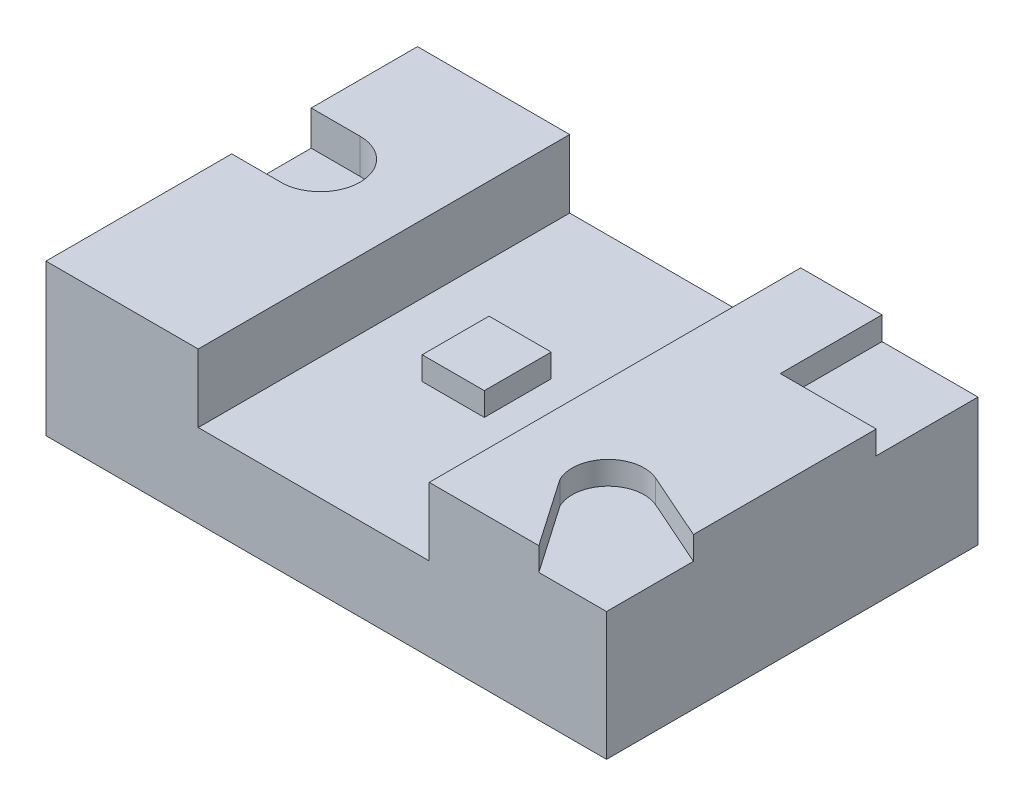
ISO-10303-21;
HEADER;
FILE_DESCRIPTION(('STEP AP214'),'2;1');
FILE_NAME('part.step','',(''),(''),'','','');
FILE_SCHEMA(('AUTOMOTIVE_DESIGN { 1 0 10303 214 1 1 1 1 }'));
ENDSEC;
DATA;
#1=APPLICATION_CONTEXT('core data for automotive mechanical design processes');
#2=APPLICATION_PROTOCOL_DEFINITION('international standard','automotive_design',2000,#1);
#3=PRODUCT_CONTEXT('',#1,'mechanical');
#4=PRODUCT('Part','Part','',(#3));
#5=PRODUCT_RELATED_PRODUCT_CATEGORY('part','',(#4));
#6=PRODUCT_DEFINITION_FORMATION('','',#4);
#7=PRODUCT_DEFINITION_CONTEXT('part definition',#1,'design');
#8=PRODUCT_DEFINITION('design','',#6,#7);
#9=PRODUCT_DEFINITION_SHAPE('','',#8);
#10=(LENGTH_UNIT() NAMED_UNIT(*) SI_UNIT(.MILLI.,.METRE.));
#11=(NAMED_UNIT(*) PLANE_ANGLE_UNIT() SI_UNIT($,.RADIAN.));
#12=(NAMED_UNIT(*) SI_UNIT($,.STERADIAN.) SOLID_ANGLE_UNIT());
#13=UNCERTAINTY_MEASURE_WITH_UNIT(LENGTH_MEASURE(1.E-05),#10,'distance_accuracy_value','');
#14=(GEOMETRIC_REPRESENTATION_CONTEXT(3) GLOBAL_UNCERTAINTY_ASSIGNED_CONTEXT((#13)) GLOBAL_UNIT_ASSIGNED_CONTEXT((#10,
#11,#12)) REPRESENTATION_CONTEXT('',''));
#15=CARTESIAN_POINT('',(0.,0.,0.));
#16=DIRECTION('',(0.,0.,1.));
#17=DIRECTION('',(1.,0.,0.));
#18=AXIS2_PLACEMENT_3D('',#15,#16,#17);
#19=CARTESIAN_POINT('',(26.4480769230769,28.4071937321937,101.6));
#20=DIRECTION('',(0.,-1.,0.));
#21=DIRECTION('',(0.,0.,-1.));
#22=AXIS2_PLACEMENT_3D('',#19,#20,#21);
#23=PLANE('',#22);
#24=DIRECTION('',(-1.,0.,0.));
#25=VECTOR('',#24,1.);
#26=CARTESIAN_POINT('',(26.4480769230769,28.4071937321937,0.));
#27=LINE('',#26,#25);
#28=CARTESIAN_POINT('',(26.4480769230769,28.4071937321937,0.));
#29=VERTEX_POINT('',#28);
#30=CARTESIAN_POINT('',(-36.7334401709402,28.4071937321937,0.));
#31=VERTEX_POINT('',#30);
#32=EDGE_CURVE('E268',#29,#31,#27,.T.);
#33=ORIENTED_EDGE('',*,*,#32,.T.);
#34=DIRECTION('',(0.,0.,-1.));
#35=VECTOR('',#34,1.);
#36=CARTESIAN_POINT('',(-36.7334401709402,28.4071937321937,101.6));
#37=LINE('',#36,#35);
#38=CARTESIAN_POINT('',(-36.7334401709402,28.4071937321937,101.6));
#39=VERTEX_POINT('',#38);
#40=EDGE_CURVE('E288',#39,#31,#37,.T.);
#41=ORIENTED_EDGE('',*,*,#40,.F.);
#42=DIRECTION('',(-1.,0.,0.));
#43=VECTOR('',#42,1.);
#44=CARTESIAN_POINT('',(26.4480769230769,28.4071937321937,101.6));
#45=LINE('',#44,#43);
#46=CARTESIAN_POINT('',(26.4480769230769,28.4071937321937,101.6));
#47=VERTEX_POINT('',#46);
#48=EDGE_CURVE('E286',#47,#39,#45,.T.);
#49=ORIENTED_EDGE('',*,*,#48,.F.);
#50=DIRECTION('',(0.,0.,-1.));
#51=VECTOR('',#50,1.);
#52=CARTESIAN_POINT('',(26.4480769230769,28.4071937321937,101.6));
#53=LINE('',#52,#51);
#54=EDGE_CURVE('E221',#47,#29,#53,.T.);
#55=ORIENTED_EDGE('',*,*,#54,.T.);
#56=EDGE_LOOP('',(#33,#41,#49,#55));
#57=FACE_BOUND('',#56,.T.);
#58=DIRECTION('',(0.,0.,-1.));
#59=VECTOR('',#58,1.);
#60=CARTESIAN_POINT('',(0.,28.4071937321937,41.7919348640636));
#61=LINE('',#60,#59);
#62=CARTESIAN_POINT('',(0.,28.4071937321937,60.0810368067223));
#63=VERTEX_POINT('',#62);
#64=CARTESIAN_POINT('',(0.,28.4071937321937,41.7919348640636));
#65=VERTEX_POINT('',#64);
#66=EDGE_CURVE('E375',#63,#65,#61,.T.);
#67=ORIENTED_EDGE('',*,*,#66,.F.);
#68=DIRECTION('',(1.,0.,0.));
#69=VECTOR('',#68,1.);
#70=CARTESIAN_POINT('',(0.,28.4071937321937,60.0810368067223));
#71=LINE('',#70,#69);
#72=CARTESIAN_POINT('',(-17.0006407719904,28.4071937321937,60.0810368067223));
#73=VERTEX_POINT('',#72);
#74=EDGE_CURVE('E368',#73,#63,#71,.T.);
#75=ORIENTED_EDGE('',*,*,#74,.F.);
#76=DIRECTION('',(0.,0.,1.));
#77=VECTOR('',#76,1.);
#78=CARTESIAN_POINT('',(-17.0006407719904,28.4071937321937,41.7919348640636));
#79=LINE('',#78,#77);
#80=CARTESIAN_POINT('',(-17.0006407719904,28.4071937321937,41.7919348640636));
#81=VERTEX_POINT('',#80);
#82=EDGE_CURVE('E371',#81,#73,#79,.T.);
#83=ORIENTED_EDGE('',*,*,#82,.F.);
#84=DIRECTION('',(-1.,0.,0.));
#85=VECTOR('',#84,1.);
#86=CARTESIAN_POINT('',(0.,28.4071937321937,41.7919348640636));
#87=LINE('',#86,#85);
#88=EDGE_CURVE('E53',#65,#81,#87,.T.);
#89=ORIENTED_EDGE('',*,*,#88,.F.);
#90=EDGE_LOOP('',(#67,#75,#83,#89));
#91=FACE_BOUND('',#90,.T.);
#92=ADVANCED_FACE('F30',(#57,#91),#23,.F.);
#93=CARTESIAN_POINT('',(-36.7334401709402,28.4071937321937,101.6));
#94=DIRECTION('',(-1.,0.,0.));
#95=DIRECTION('',(0.,0.,1.));
#96=AXIS2_PLACEMENT_3D('',#93,#94,#95);
#97=PLANE('',#96);
#98=DIRECTION('',(0.,1.,0.));
#99=VECTOR('',#98,1.);
#100=CARTESIAN_POINT('',(-36.7334401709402,28.4071937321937,0.));
#101=LINE('',#100,#99);
#102=CARTESIAN_POINT('',(-36.7334401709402,47.0188034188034,0.));
#103=VERTEX_POINT('',#102);
#104=EDGE_CURVE('E250',#31,#103,#101,.T.);
#105=ORIENTED_EDGE('',*,*,#104,.T.);
#106=DIRECTION('',(0.,0.,-1.));
#107=VECTOR('',#106,1.);
#108=CARTESIAN_POINT('',(-36.7334401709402,47.0188034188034,101.6));
#109=LINE('',#108,#107);
#110=CARTESIAN_POINT('',(-36.7334401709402,47.0188034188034,101.6));
#111=VERTEX_POINT('',#110);
#112=EDGE_CURVE('E11',#111,#103,#109,.T.);
#113=ORIENTED_EDGE('',*,*,#112,.F.);
#114=DIRECTION('',(0.,1.,0.));
#115=VECTOR('',#114,1.);
#116=CARTESIAN_POINT('',(-36.7334401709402,28.4071937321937,101.6));
#117=LINE('',#116,#115);
#118=EDGE_CURVE('E270',#39,#111,#117,.T.);
#119=ORIENTED_EDGE('',*,*,#118,.F.);
#120=ORIENTED_EDGE('',*,*,#40,.T.);
#121=EDGE_LOOP('',(#105,#113,#119,#120));
#122=FACE_BOUND('',#121,.T.);
#123=ADVANCED_FACE('F32',(#122),#97,.F.);
#124=CARTESIAN_POINT('',(-36.7334401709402,47.0188034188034,101.6));
#125=DIRECTION('',(0.,-1.,0.));
#126=DIRECTION('',(0.,0.,-1.));
#127=AXIS2_PLACEMENT_3D('',#124,#125,#126);
#128=PLANE('',#127);
#129=DIRECTION('',(0.,0.,-1.));
#130=VECTOR('',#129,1.);
#131=CARTESIAN_POINT('',(-78.3646723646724,47.0188034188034,101.6));
#132=LINE('',#131,#130);
#133=CARTESIAN_POINT('',(-78.3646723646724,47.0188034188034,29.0680440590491));
#134=VERTEX_POINT('',#133);
#135=CARTESIAN_POINT('',(-78.3646723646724,47.0188034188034,0.));
#136=VERTEX_POINT('',#135);
#137=EDGE_CURVE('E226',#134,#136,#132,.T.);
#138=ORIENTED_EDGE('',*,*,#137,.F.);
#139=DIRECTION('',(-1.,0.,0.));
#140=VECTOR('',#139,1.);
#141=CARTESIAN_POINT('',(-78.3646723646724,47.0188034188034,29.0680440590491));
#142=LINE('',#141,#140);
#143=CARTESIAN_POINT('',(-64.9824682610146,47.0188034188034,29.0680440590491));
#144=VERTEX_POINT('',#143);
#145=EDGE_CURVE('E340',#144,#134,#142,.T.);
#146=ORIENTED_EDGE('',*,*,#145,.F.);
#147=CARTESIAN_POINT('',(-64.9824682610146,47.0188034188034,39.9552004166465));
#148=DIRECTION('',(0.,1.,0.));
#149=DIRECTION('',(0.,0.,-1.));
#150=AXIS2_PLACEMENT_3D('',#147,#148,#149);
#151=CIRCLE('',#150,10.8871563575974);
#152=CARTESIAN_POINT('',(-64.023043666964,47.0188034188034,50.8));
#153=VERTEX_POINT('',#152);
#154=EDGE_CURVE('E342',#153,#144,#151,.T.);
#155=ORIENTED_EDGE('',*,*,#154,.F.);
#156=DIRECTION('',(1.,0.,0.));
#157=VECTOR('',#156,1.);
#158=CARTESIAN_POINT('',(-64.023043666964,47.0188034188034,50.8));
#159=LINE('',#158,#157);
#160=CARTESIAN_POINT('',(-78.3646723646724,47.0188034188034,50.8));
#161=VERTEX_POINT('',#160);
#162=EDGE_CURVE('E345',#161,#153,#159,.T.);
#163=ORIENTED_EDGE('',*,*,#162,.F.);
#164=CARTESIAN_POINT('',(-78.3646723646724,47.0188034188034,101.6));
#165=VERTEX_POINT('',#164);
#166=EDGE_CURVE('E38',#165,#161,#132,.T.);
#167=ORIENTED_EDGE('',*,*,#166,.F.);
#168=DIRECTION('',(-1.,0.,0.));
#169=VECTOR('',#168,1.);
#170=CARTESIAN_POINT('',(-36.7334401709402,47.0188034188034,101.6));
#171=LINE('',#170,#169);
#172=EDGE_CURVE('E273',#111,#165,#171,.T.);
#173=ORIENTED_EDGE('',*,*,#172,.F.);
#174=ORIENTED_EDGE('',*,*,#112,.T.);
#175=DIRECTION('',(-1.,0.,0.));
#176=VECTOR('',#175,1.);
#177=CARTESIAN_POINT('',(-36.7334401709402,47.0188034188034,0.));
#178=LINE('',#177,#176);
#179=EDGE_CURVE('E244',#103,#136,#178,.T.);
#180=ORIENTED_EDGE('',*,*,#179,.T.);
#181=EDGE_LOOP('',(#138,#146,#155,#163,#167,#173,#174,#180));
#182=FACE_BOUND('',#181,.T.);
#183=ADVANCED_FACE('F245',(#182),#128,.F.);
#184=CARTESIAN_POINT('',(-78.3646723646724,47.0188034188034,101.6));
#185=DIRECTION('',(1.,0.,0.));
#186=DIRECTION('',(0.,0.,-1.));
#187=AXIS2_PLACEMENT_3D('',#184,#185,#186);
#188=PLANE('',#187);
#189=DIRECTION('',(0.,0.,1.));
#190=VECTOR('',#189,1.);
#191=CARTESIAN_POINT('',(-78.3646723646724,37.4938034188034,50.8));
#192=LINE('',#191,#190);
#193=CARTESIAN_POINT('',(-78.3646723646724,37.4938034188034,29.0680440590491));
#194=VERTEX_POINT('',#193);
#195=CARTESIAN_POINT('',(-78.3646723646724,37.4938034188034,50.8));
#196=VERTEX_POINT('',#195);
#197=EDGE_CURVE('E337',#194,#196,#192,.T.);
#198=ORIENTED_EDGE('',*,*,#197,.F.);
#199=DIRECTION('',(0.,1.,0.));
#200=VECTOR('',#199,1.);
#201=CARTESIAN_POINT('',(-78.3646723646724,37.4938034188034,29.0680440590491));
#202=LINE('',#201,#200);
#203=EDGE_CURVE('E241',#194,#134,#202,.T.);
#204=ORIENTED_EDGE('',*,*,#203,.T.);
#205=ORIENTED_EDGE('',*,*,#137,.T.);
#206=DIRECTION('',(0.,-1.,0.));
#207=VECTOR('',#206,1.);
#208=CARTESIAN_POINT('',(-78.3646723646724,47.0188034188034,0.));
#209=LINE('',#208,#207);
#210=CARTESIAN_POINT('',(-78.3646723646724,5.64473629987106,0.));
#211=VERTEX_POINT('',#210);
#212=EDGE_CURVE('E239',#136,#211,#209,.T.);
#213=ORIENTED_EDGE('',*,*,#212,.T.);
#214=DIRECTION('',(0.,0.,-1.));
#215=VECTOR('',#214,1.);
#216=CARTESIAN_POINT('',(-78.3646723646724,5.64473629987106,101.6));
#217=LINE('',#216,#215);
#218=CARTESIAN_POINT('',(-78.3646723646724,5.64473629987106,101.6));
#219=VERTEX_POINT('',#218);
#220=EDGE_CURVE('E218',#219,#211,#217,.T.);
#221=ORIENTED_EDGE('',*,*,#220,.F.);
#222=DIRECTION('',(0.,-1.,0.));
#223=VECTOR('',#222,1.);
#224=CARTESIAN_POINT('',(-78.3646723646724,47.0188034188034,101.6));
#225=LINE('',#224,#223);
#226=EDGE_CURVE('E275',#165,#219,#225,.T.);
#227=ORIENTED_EDGE('',*,*,#226,.F.);
#228=ORIENTED_EDGE('',*,*,#166,.T.);
#229=DIRECTION('',(0.,1.,0.));
#230=VECTOR('',#229,1.);
#231=CARTESIAN_POINT('',(-78.3646723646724,37.4938034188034,50.8));
#232=LINE('',#231,#230);
#233=EDGE_CURVE('E322',#196,#161,#232,.T.);
#234=ORIENTED_EDGE('',*,*,#233,.F.);
#235=EDGE_LOOP('',(#198,#204,#205,#213,#221,#227,#228,#234));
#236=FACE_BOUND('',#235,.T.);
#237=ADVANCED_FACE('F236',(#236),#188,.F.);
#238=CARTESIAN_POINT('',(-78.3646723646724,5.64473629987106,101.6));
#239=DIRECTION('',(0.,1.,0.));
#240=DIRECTION('',(0.,0.,1.));
#241=AXIS2_PLACEMENT_3D('',#238,#239,#240);
#242=PLANE('',#241);
#243=DIRECTION('',(1.,0.,0.));
#244=VECTOR('',#243,1.);
#245=CARTESIAN_POINT('',(-78.3646723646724,5.64473629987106,0.));
#246=LINE('',#245,#244);
#247=CARTESIAN_POINT('',(74.936217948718,5.64473629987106,0.));
#248=VERTEX_POINT('',#247);
#249=EDGE_CURVE('E256',#211,#248,#246,.T.);
#250=ORIENTED_EDGE('',*,*,#249,.T.);
#251=DIRECTION('',(0.,0.,-1.));
#252=VECTOR('',#251,1.);
#253=CARTESIAN_POINT('',(74.936217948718,5.64473629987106,101.6));
#254=LINE('',#253,#252);
#255=CARTESIAN_POINT('',(74.936217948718,5.64473629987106,101.6));
#256=VERTEX_POINT('',#255);
#257=EDGE_CURVE('E214',#256,#248,#254,.T.);
#258=ORIENTED_EDGE('',*,*,#257,.F.);
#259=DIRECTION('',(1.,0.,0.));
#260=VECTOR('',#259,1.);
#261=CARTESIAN_POINT('',(-78.3646723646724,5.64473629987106,101.6));
#262=LINE('',#261,#260);
#263=EDGE_CURVE('E277',#219,#256,#262,.T.);
#264=ORIENTED_EDGE('',*,*,#263,.F.);
#265=ORIENTED_EDGE('',*,*,#220,.T.);
#266=EDGE_LOOP('',(#250,#258,#264,#265));
#267=FACE_BOUND('',#266,.T.);
#268=ADVANCED_FACE('F441',(#267),#242,.F.);
#269=CARTESIAN_POINT('',(74.936217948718,5.64473629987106,101.6));
#270=DIRECTION('',(-1.,0.,0.));
#271=DIRECTION('',(0.,0.,1.));
#272=AXIS2_PLACEMENT_3D('',#269,#270,#271);
#273=PLANE('',#272);
#274=DIRECTION('',(0.,0.,-1.));
#275=VECTOR('',#274,1.);
#276=CARTESIAN_POINT('',(74.936217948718,47.0188034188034,101.6));
#277=LINE('',#276,#275);
#278=CARTESIAN_POINT('',(74.936217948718,47.0188034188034,77.8241954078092));
#279=VERTEX_POINT('',#278);
#280=CARTESIAN_POINT('',(74.936217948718,47.0188034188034,27.8295859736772));
#281=VERTEX_POINT('',#280);
#282=EDGE_CURVE('E204',#279,#281,#277,.T.);
#283=ORIENTED_EDGE('',*,*,#282,.F.);
#284=DIRECTION('',(0.,1.,0.));
#285=VECTOR('',#284,1.);
#286=CARTESIAN_POINT('',(74.936217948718,40.6688034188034,77.8241954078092));
#287=LINE('',#286,#285);
#288=CARTESIAN_POINT('',(74.936217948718,40.6688034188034,77.8241954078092));
#289=VERTEX_POINT('',#288);
#290=EDGE_CURVE('E186',#289,#279,#287,.T.);
#291=ORIENTED_EDGE('',*,*,#290,.F.);
#292=DIRECTION('',(0.,0.,-1.));
#293=VECTOR('',#292,1.);
#294=CARTESIAN_POINT('',(74.936217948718,40.6688034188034,101.6));
#295=LINE('',#294,#293);
#296=CARTESIAN_POINT('',(74.936217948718,40.6688034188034,101.6));
#297=VERTEX_POINT('',#296);
#298=EDGE_CURVE('E389',#297,#289,#295,.T.);
#299=ORIENTED_EDGE('',*,*,#298,.F.);
#300=DIRECTION('',(0.,1.,0.));
#301=VECTOR('',#300,1.);
#302=CARTESIAN_POINT('',(74.936217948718,5.64473629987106,101.6));
#303=LINE('',#302,#301);
#304=EDGE_CURVE('E279',#256,#297,#303,.T.);
#305=ORIENTED_EDGE('',*,*,#304,.F.);
#306=ORIENTED_EDGE('',*,*,#257,.T.);
#307=DIRECTION('',(0.,1.,0.));
#308=VECTOR('',#307,1.);
#309=CARTESIAN_POINT('',(74.936217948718,5.64473629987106,0.));
#310=LINE('',#309,#308);
#311=CARTESIAN_POINT('',(74.936217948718,40.6688034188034,0.));
#312=VERTEX_POINT('',#311);
#313=EDGE_CURVE('E258',#248,#312,#310,.T.);
#314=ORIENTED_EDGE('',*,*,#313,.T.);
#315=DIRECTION('',(0.,0.,-1.));
#316=VECTOR('',#315,1.);
#317=CARTESIAN_POINT('',(74.936217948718,40.6688034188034,0.));
#318=LINE('',#317,#316);
#319=CARTESIAN_POINT('',(74.936217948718,40.6688034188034,27.8295859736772));
#320=VERTEX_POINT('',#319);
#321=EDGE_CURVE('E309',#320,#312,#318,.T.);
#322=ORIENTED_EDGE('',*,*,#321,.F.);
#323=DIRECTION('',(0.,1.,0.));
#324=VECTOR('',#323,1.);
#325=CARTESIAN_POINT('',(74.936217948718,40.6688034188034,27.8295859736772));
#326=LINE('',#325,#324);
#327=EDGE_CURVE('E213',#320,#281,#326,.T.);
#328=ORIENTED_EDGE('',*,*,#327,.T.);
#329=EDGE_LOOP('',(#283,#291,#299,#305,#306,#314,#322,#328));
#330=FACE_BOUND('',#329,.T.);
#331=ADVANCED_FACE('F211',(#330),#273,.F.);
#332=CARTESIAN_POINT('',(74.936217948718,47.0188034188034,101.6));
#333=DIRECTION('',(0.,-1.,0.));
#334=DIRECTION('',(0.,0.,-1.));
#335=AXIS2_PLACEMENT_3D('',#332,#333,#334);
#336=PLANE('',#335);
#337=DIRECTION('',(-1.,0.,0.));
#338=VECTOR('',#337,1.);
#339=CARTESIAN_POINT('',(74.936217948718,47.0188034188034,101.6));
#340=LINE('',#339,#338);
#341=CARTESIAN_POINT('',(56.4287386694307,47.0188034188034,101.6));
#342=VERTEX_POINT('',#341);
#343=CARTESIAN_POINT('',(26.4480769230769,47.0188034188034,101.6));
#344=VERTEX_POINT('',#343);
#345=EDGE_CURVE('E282',#342,#344,#340,.T.);
#346=ORIENTED_EDGE('',*,*,#345,.F.);
#347=DIRECTION('',(0.568015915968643,0.,0.823017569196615));
#348=VECTOR('',#347,1.);
#349=CARTESIAN_POINT('',(43.5990701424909,47.0188034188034,83.0106571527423));
#350=LINE('',#349,#348);
#351=CARTESIAN_POINT('',(43.5990701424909,47.0188034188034,83.0106571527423));
#352=VERTEX_POINT('',#351);
#353=EDGE_CURVE('E391',#352,#342,#350,.T.);
#354=ORIENTED_EDGE('',*,*,#353,.F.);
#355=CARTESIAN_POINT('',(52.4398981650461,47.0188034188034,78.6498248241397));
#356=DIRECTION('',(0.,1.,0.));
#357=DIRECTION('',(0.,0.,1.));
#358=AXIS2_PLACEMENT_3D('',#355,#356,#357);
#359=CIRCLE('',#358,9.85784452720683);
#360=CARTESIAN_POINT('',(56.4287386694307,47.0188034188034,69.6350452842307));
#361=VERTEX_POINT('',#360);
#362=EDGE_CURVE('E208',#361,#352,#359,.T.);
#363=ORIENTED_EDGE('',*,*,#362,.F.);
#364=DIRECTION('',(-0.914477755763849,0.,-0.404636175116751));
#365=VECTOR('',#364,1.);
#366=CARTESIAN_POINT('',(74.936217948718,47.0188034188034,77.8241954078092));
#367=LINE('',#366,#365);
#368=EDGE_CURVE('E189',#279,#361,#367,.T.);
#369=ORIENTED_EDGE('',*,*,#368,.F.);
#370=ORIENTED_EDGE('',*,*,#282,.T.);
#371=DIRECTION('',(1.,0.,0.));
#372=VECTOR('',#371,1.);
#373=CARTESIAN_POINT('',(48.688505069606,47.0188034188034,27.8295859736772));
#374=LINE('',#373,#372);
#375=CARTESIAN_POINT('',(48.688505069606,47.0188034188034,27.8295859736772));
#376=VERTEX_POINT('',#375);
#377=EDGE_CURVE('E317',#376,#281,#374,.T.);
#378=ORIENTED_EDGE('',*,*,#377,.F.);
#379=DIRECTION('',(0.,0.,1.));
#380=VECTOR('',#379,1.);
#381=CARTESIAN_POINT('',(48.688505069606,47.0188034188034,0.));
#382=LINE('',#381,#380);
#383=CARTESIAN_POINT('',(48.688505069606,47.0188034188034,0.));
#384=VERTEX_POINT('',#383);
#385=EDGE_CURVE('E319',#384,#376,#382,.T.);
#386=ORIENTED_EDGE('',*,*,#385,.F.);
#387=DIRECTION('',(-1.,0.,0.));
#388=VECTOR('',#387,1.);
#389=CARTESIAN_POINT('',(74.936217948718,47.0188034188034,0.));
#390=LINE('',#389,#388);
#391=CARTESIAN_POINT('',(26.4480769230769,47.0188034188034,0.));
#392=VERTEX_POINT('',#391);
#393=EDGE_CURVE('E264',#384,#392,#390,.T.);
#394=ORIENTED_EDGE('',*,*,#393,.T.);
#395=DIRECTION('',(0.,0.,-1.));
#396=VECTOR('',#395,1.);
#397=CARTESIAN_POINT('',(26.4480769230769,47.0188034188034,101.6));
#398=LINE('',#397,#396);
#399=EDGE_CURVE('E215',#344,#392,#398,.T.);
#400=ORIENTED_EDGE('',*,*,#399,.F.);
#401=EDGE_LOOP('',(#346,#354,#363,#369,#370,#378,#386,#394,#400));
#402=FACE_BOUND('',#401,.T.);
#403=ADVANCED_FACE('F202',(#402),#336,.F.);
#404=CARTESIAN_POINT('',(26.4480769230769,47.0188034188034,101.6));
#405=DIRECTION('',(1.,0.,0.));
#406=DIRECTION('',(0.,0.,-1.));
#407=AXIS2_PLACEMENT_3D('',#404,#405,#406);
#408=PLANE('',#407);
#409=DIRECTION('',(0.,-1.,0.));
#410=VECTOR('',#409,1.);
#411=CARTESIAN_POINT('',(26.4480769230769,47.0188034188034,0.));
#412=LINE('',#411,#410);
#413=EDGE_CURVE('E266',#392,#29,#412,.T.);
#414=ORIENTED_EDGE('',*,*,#413,.T.);
#415=ORIENTED_EDGE('',*,*,#54,.F.);
#416=DIRECTION('',(0.,-1.,0.));
#417=VECTOR('',#416,1.);
#418=CARTESIAN_POINT('',(26.4480769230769,47.0188034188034,101.6));
#419=LINE('',#418,#417);
#420=EDGE_CURVE('E284',#344,#47,#419,.T.);
#421=ORIENTED_EDGE('',*,*,#420,.F.);
#422=ORIENTED_EDGE('',*,*,#399,.T.);
#423=EDGE_LOOP('',(#414,#415,#421,#422));
#424=FACE_BOUND('',#423,.T.);
#425=ADVANCED_FACE('F434',(#424),#408,.F.);
#426=CARTESIAN_POINT('',(-36.7334401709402,47.0188034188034,101.6));
#427=DIRECTION('',(0.,0.,1.));
#428=DIRECTION('',(1.,0.,0.));
#429=AXIS2_PLACEMENT_3D('',#426,#427,#428);
#430=PLANE('',#429);
#431=DIRECTION('',(0.,1.,0.));
#432=VECTOR('',#431,1.);
#433=CARTESIAN_POINT('',(56.4287386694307,40.6688034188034,101.6));
#434=LINE('',#433,#432);
#435=CARTESIAN_POINT('',(56.4287386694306,40.6688034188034,101.6));
#436=VERTEX_POINT('',#435);
#437=EDGE_CURVE('E377',#436,#342,#434,.T.);
#438=ORIENTED_EDGE('',*,*,#437,.T.);
#439=ORIENTED_EDGE('',*,*,#345,.T.);
#440=ORIENTED_EDGE('',*,*,#420,.T.);
#441=ORIENTED_EDGE('',*,*,#48,.T.);
#442=ORIENTED_EDGE('',*,*,#118,.T.);
#443=ORIENTED_EDGE('',*,*,#172,.T.);
#444=ORIENTED_EDGE('',*,*,#226,.T.);
#445=ORIENTED_EDGE('',*,*,#263,.T.);
#446=ORIENTED_EDGE('',*,*,#304,.T.);
#447=DIRECTION('',(1.,0.,0.));
#448=VECTOR('',#447,1.);
#449=CARTESIAN_POINT('',(56.4287386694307,40.6688034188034,101.6));
#450=LINE('',#449,#448);
#451=EDGE_CURVE('E198',#436,#297,#450,.T.);
#452=ORIENTED_EDGE('',*,*,#451,.F.);
#453=EDGE_LOOP('',(#438,#439,#440,#441,#442,#443,#444,#445,#446,#452));
#454=FACE_BOUND('',#453,.T.);
#455=ADVANCED_FACE('F401',(#454),#430,.T.);
#456=CARTESIAN_POINT('',(-36.7334401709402,47.0188034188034,0.));
#457=DIRECTION('',(0.,0.,1.));
#458=DIRECTION('',(1.,0.,0.));
#459=AXIS2_PLACEMENT_3D('',#456,#457,#458);
#460=PLANE('',#459);
#461=ORIENTED_EDGE('',*,*,#393,.F.);
#462=DIRECTION('',(0.,1.,0.));
#463=VECTOR('',#462,1.);
#464=CARTESIAN_POINT('',(48.688505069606,40.6688034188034,0.));
#465=LINE('',#464,#463);
#466=CARTESIAN_POINT('',(48.688505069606,40.6688034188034,0.));
#467=VERTEX_POINT('',#466);
#468=EDGE_CURVE('E300',#467,#384,#465,.T.);
#469=ORIENTED_EDGE('',*,*,#468,.F.);
#470=DIRECTION('',(-1.,0.,0.));
#471=VECTOR('',#470,1.);
#472=CARTESIAN_POINT('',(48.688505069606,40.6688034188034,0.));
#473=LINE('',#472,#471);
#474=EDGE_CURVE('E305',#312,#467,#473,.T.);
#475=ORIENTED_EDGE('',*,*,#474,.F.);
#476=ORIENTED_EDGE('',*,*,#313,.F.);
#477=ORIENTED_EDGE('',*,*,#249,.F.);
#478=ORIENTED_EDGE('',*,*,#212,.F.);
#479=ORIENTED_EDGE('',*,*,#179,.F.);
#480=ORIENTED_EDGE('',*,*,#104,.F.);
#481=ORIENTED_EDGE('',*,*,#32,.F.);
#482=ORIENTED_EDGE('',*,*,#413,.F.);
#483=EDGE_LOOP('',(#461,#469,#475,#476,#477,#478,#479,#480,#481,#482));
#484=FACE_BOUND('',#483,.T.);
#485=ADVANCED_FACE('F254',(#484),#460,.F.);
#486=CARTESIAN_POINT('',(48.688505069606,40.6688034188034,0.));
#487=DIRECTION('',(-1.,0.,0.));
#488=DIRECTION('',(0.,0.,1.));
#489=AXIS2_PLACEMENT_3D('',#486,#487,#488);
#490=PLANE('',#489);
#491=ORIENTED_EDGE('',*,*,#385,.T.);
#492=DIRECTION('',(0.,1.,0.));
#493=VECTOR('',#492,1.);
#494=CARTESIAN_POINT('',(48.688505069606,40.6688034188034,27.8295859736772));
#495=LINE('',#494,#493);
#496=CARTESIAN_POINT('',(48.688505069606,40.6688034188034,27.8295859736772));
#497=VERTEX_POINT('',#496);
#498=EDGE_CURVE('E303',#497,#376,#495,.T.);
#499=ORIENTED_EDGE('',*,*,#498,.F.);
#500=DIRECTION('',(0.,0.,1.));
#501=VECTOR('',#500,1.);
#502=CARTESIAN_POINT('',(48.688505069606,40.6688034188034,0.));
#503=LINE('',#502,#501);
#504=EDGE_CURVE('E314',#467,#497,#503,.T.);
#505=ORIENTED_EDGE('',*,*,#504,.F.);
#506=ORIENTED_EDGE('',*,*,#468,.T.);
#507=EDGE_LOOP('',(#491,#499,#505,#506));
#508=FACE_BOUND('',#507,.T.);
#509=ADVANCED_FACE('F416',(#508),#490,.F.);
#510=CARTESIAN_POINT('',(48.688505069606,40.6688034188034,27.8295859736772));
#511=DIRECTION('',(0.,0.,1.));
#512=DIRECTION('',(1.,0.,0.));
#513=AXIS2_PLACEMENT_3D('',#510,#511,#512);
#514=PLANE('',#513);
#515=ORIENTED_EDGE('',*,*,#377,.T.);
#516=ORIENTED_EDGE('',*,*,#327,.F.);
#517=DIRECTION('',(1.,0.,0.));
#518=VECTOR('',#517,1.);
#519=CARTESIAN_POINT('',(48.688505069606,40.6688034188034,27.8295859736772));
#520=LINE('',#519,#518);
#521=EDGE_CURVE('E311',#497,#320,#520,.T.);
#522=ORIENTED_EDGE('',*,*,#521,.F.);
#523=ORIENTED_EDGE('',*,*,#498,.T.);
#524=EDGE_LOOP('',(#515,#516,#522,#523));
#525=FACE_BOUND('',#524,.T.);
#526=ADVANCED_FACE('F413',(#525),#514,.F.);
#527=CARTESIAN_POINT('',(48.688505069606,40.6688034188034,27.8295859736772));
#528=DIRECTION('',(0.,1.,0.));
#529=DIRECTION('',(0.,0.,1.));
#530=AXIS2_PLACEMENT_3D('',#527,#528,#529);
#531=PLANE('',#530);
#532=ORIENTED_EDGE('',*,*,#504,.T.);
#533=ORIENTED_EDGE('',*,*,#521,.T.);
#534=ORIENTED_EDGE('',*,*,#321,.T.);
#535=ORIENTED_EDGE('',*,*,#474,.T.);
#536=EDGE_LOOP('',(#532,#533,#534,#535));
#537=FACE_BOUND('',#536,.T.);
#538=ADVANCED_FACE('F410',(#537),#531,.T.);
#539=CARTESIAN_POINT('',(-78.3646723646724,37.4938034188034,29.0680440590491));
#540=DIRECTION('',(0.,0.,-1.));
#541=DIRECTION('',(-1.,0.,0.));
#542=AXIS2_PLACEMENT_3D('',#539,#540,#541);
#543=PLANE('',#542);
#544=ORIENTED_EDGE('',*,*,#145,.T.);
#545=ORIENTED_EDGE('',*,*,#203,.F.);
#546=DIRECTION('',(-1.,0.,0.));
#547=VECTOR('',#546,1.);
#548=CARTESIAN_POINT('',(-78.3646723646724,37.4938034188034,29.0680440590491));
#549=LINE('',#548,#547);
#550=CARTESIAN_POINT('',(-64.9824682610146,37.4938034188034,29.0680440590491));
#551=VERTEX_POINT('',#550);
#552=EDGE_CURVE('E325',#551,#194,#549,.T.);
#553=ORIENTED_EDGE('',*,*,#552,.F.);
#554=DIRECTION('',(0.,1.,0.));
#555=VECTOR('',#554,1.);
#556=CARTESIAN_POINT('',(-64.9824682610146,37.4938034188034,29.0680440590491));
#557=LINE('',#556,#555);
#558=EDGE_CURVE('E327',#551,#144,#557,.T.);
#559=ORIENTED_EDGE('',*,*,#558,.T.);
#560=EDGE_LOOP('',(#544,#545,#553,#559));
#561=FACE_BOUND('',#560,.T.);
#562=ADVANCED_FACE('F460',(#561),#543,.F.);
#563=CARTESIAN_POINT('',(-64.9824682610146,37.4938034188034,39.9552004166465));
#564=DIRECTION('',(0.,1.,0.));
#565=DIRECTION('',(0.,0.,1.));
#566=AXIS2_PLACEMENT_3D('',#563,#564,#565);
#567=CYLINDRICAL_SURFACE('',#566,10.8871563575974);
#568=ORIENTED_EDGE('',*,*,#154,.T.);
#569=ORIENTED_EDGE('',*,*,#558,.F.);
#570=CARTESIAN_POINT('',(-64.9824682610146,37.4938034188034,39.9552004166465));
#571=DIRECTION('',(0.,1.,0.));
#572=DIRECTION('',(0.,0.,-1.));
#573=AXIS2_PLACEMENT_3D('',#570,#571,#572);
#574=CIRCLE('',#573,10.8871563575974);
#575=CARTESIAN_POINT('',(-64.023043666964,37.4938034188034,50.8));
#576=VERTEX_POINT('',#575);
#577=EDGE_CURVE('E331',#576,#551,#574,.T.);
#578=ORIENTED_EDGE('',*,*,#577,.F.);
#579=DIRECTION('',(0.,1.,0.));
#580=VECTOR('',#579,1.);
#581=CARTESIAN_POINT('',(-64.023043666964,37.4938034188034,50.8));
#582=LINE('',#581,#580);
#583=EDGE_CURVE('E324',#576,#153,#582,.T.);
#584=ORIENTED_EDGE('',*,*,#583,.T.);
#585=EDGE_LOOP('',(#568,#569,#578,#584));
#586=FACE_BOUND('',#585,.T.);
#587=ADVANCED_FACE('F464',(#586),#567,.F.);
#588=CARTESIAN_POINT('',(-64.023043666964,37.4938034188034,50.8));
#589=DIRECTION('',(0.,0.,1.));
#590=DIRECTION('',(1.,0.,0.));
#591=AXIS2_PLACEMENT_3D('',#588,#589,#590);
#592=PLANE('',#591);
#593=ORIENTED_EDGE('',*,*,#162,.T.);
#594=ORIENTED_EDGE('',*,*,#583,.F.);
#595=DIRECTION('',(1.,0.,0.));
#596=VECTOR('',#595,1.);
#597=CARTESIAN_POINT('',(-64.023043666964,37.4938034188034,50.8));
#598=LINE('',#597,#596);
#599=EDGE_CURVE('E334',#196,#576,#598,.T.);
#600=ORIENTED_EDGE('',*,*,#599,.F.);
#601=ORIENTED_EDGE('',*,*,#233,.T.);
#602=EDGE_LOOP('',(#593,#594,#600,#601));
#603=FACE_BOUND('',#602,.T.);
#604=ADVANCED_FACE('F472',(#603),#592,.F.);
#605=CARTESIAN_POINT('',(-64.9824682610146,37.4938034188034,39.9552004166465));
#606=DIRECTION('',(0.,-1.,0.));
#607=DIRECTION('',(0.,0.,-1.));
#608=AXIS2_PLACEMENT_3D('',#605,#606,#607);
#609=PLANE('',#608);
#610=ORIENTED_EDGE('',*,*,#197,.T.);
#611=ORIENTED_EDGE('',*,*,#599,.T.);
#612=ORIENTED_EDGE('',*,*,#577,.T.);
#613=ORIENTED_EDGE('',*,*,#552,.T.);
#614=EDGE_LOOP('',(#610,#611,#612,#613));
#615=FACE_BOUND('',#614,.T.);
#616=ADVANCED_FACE('F479',(#615),#609,.F.);
#617=CARTESIAN_POINT('',(0.,34.7571937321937,41.7919348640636));
#618=DIRECTION('',(-1.,0.,0.));
#619=DIRECTION('',(0.,0.,1.));
#620=AXIS2_PLACEMENT_3D('',#617,#618,#619);
#621=PLANE('',#620);
#622=ORIENTED_EDGE('',*,*,#66,.T.);
#623=DIRECTION('',(0.,-1.,0.));
#624=VECTOR('',#623,1.);
#625=CARTESIAN_POINT('',(0.,34.7571937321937,41.7919348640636));
#626=LINE('',#625,#624);
#627=CARTESIAN_POINT('',(0.,34.7571937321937,41.7919348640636));
#628=VERTEX_POINT('',#627);
#629=EDGE_CURVE('E348',#628,#65,#626,.T.);
#630=ORIENTED_EDGE('',*,*,#629,.F.);
#631=DIRECTION('',(0.,0.,-1.));
#632=VECTOR('',#631,1.);
#633=CARTESIAN_POINT('',(0.,34.7571937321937,41.7919348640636));
#634=LINE('',#633,#632);
#635=CARTESIAN_POINT('',(0.,34.7571937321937,60.0810368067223));
#636=VERTEX_POINT('',#635);
#637=EDGE_CURVE('E365',#636,#628,#634,.T.);
#638=ORIENTED_EDGE('',*,*,#637,.F.);
#639=DIRECTION('',(0.,-1.,0.));
#640=VECTOR('',#639,1.);
#641=CARTESIAN_POINT('',(0.,34.7571937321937,60.0810368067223));
#642=LINE('',#641,#640);
#643=EDGE_CURVE('E356',#636,#63,#642,.T.);
#644=ORIENTED_EDGE('',*,*,#643,.T.);
#645=EDGE_LOOP('',(#622,#630,#638,#644));
#646=FACE_BOUND('',#645,.T.);
#647=ADVANCED_FACE('F486',(#646),#621,.F.);
#648=CARTESIAN_POINT('',(0.,34.7571937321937,41.7919348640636));
#649=DIRECTION('',(0.,0.,1.));
#650=DIRECTION('',(1.,0.,0.));
#651=AXIS2_PLACEMENT_3D('',#648,#649,#650);
#652=PLANE('',#651);
#653=ORIENTED_EDGE('',*,*,#88,.T.);
#654=DIRECTION('',(0.,-1.,0.));
#655=VECTOR('',#654,1.);
#656=CARTESIAN_POINT('',(-17.0006407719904,34.7571937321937,41.7919348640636));
#657=LINE('',#656,#655);
#658=CARTESIAN_POINT('',(-17.0006407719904,34.7571937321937,41.7919348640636));
#659=VERTEX_POINT('',#658);
#660=EDGE_CURVE('E350',#659,#81,#657,.T.);
#661=ORIENTED_EDGE('',*,*,#660,.F.);
#662=DIRECTION('',(-1.,0.,0.));
#663=VECTOR('',#662,1.);
#664=CARTESIAN_POINT('',(0.,34.7571937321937,41.7919348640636));
#665=LINE('',#664,#663);
#666=EDGE_CURVE('E363',#628,#659,#665,.T.);
#667=ORIENTED_EDGE('',*,*,#666,.F.);
#668=ORIENTED_EDGE('',*,*,#629,.T.);
#669=EDGE_LOOP('',(#653,#661,#667,#668));
#670=FACE_BOUND('',#669,.T.);
#671=ADVANCED_FACE('F497',(#670),#652,.F.);
#672=CARTESIAN_POINT('',(-17.0006407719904,34.7571937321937,41.7919348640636));
#673=DIRECTION('',(1.,0.,0.));
#674=DIRECTION('',(0.,0.,-1.));
#675=AXIS2_PLACEMENT_3D('',#672,#673,#674);
#676=PLANE('',#675);
#677=ORIENTED_EDGE('',*,*,#82,.T.);
#678=DIRECTION('',(0.,-1.,0.));
#679=VECTOR('',#678,1.);
#680=CARTESIAN_POINT('',(-17.0006407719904,34.7571937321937,60.0810368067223));
#681=LINE('',#680,#679);
#682=CARTESIAN_POINT('',(-17.0006407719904,34.7571937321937,60.0810368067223));
#683=VERTEX_POINT('',#682);
#684=EDGE_CURVE('E353',#683,#73,#681,.T.);
#685=ORIENTED_EDGE('',*,*,#684,.F.);
#686=DIRECTION('',(0.,0.,1.));
#687=VECTOR('',#686,1.);
#688=CARTESIAN_POINT('',(-17.0006407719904,34.7571937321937,41.7919348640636));
#689=LINE('',#688,#687);
#690=EDGE_CURVE('E361',#659,#683,#689,.T.);
#691=ORIENTED_EDGE('',*,*,#690,.F.);
#692=ORIENTED_EDGE('',*,*,#660,.T.);
#693=EDGE_LOOP('',(#677,#685,#691,#692));
#694=FACE_BOUND('',#693,.T.);
#695=ADVANCED_FACE('F505',(#694),#676,.F.);
#696=CARTESIAN_POINT('',(0.,34.7571937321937,60.0810368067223));
#697=DIRECTION('',(0.,0.,-1.));
#698=DIRECTION('',(-1.,0.,0.));
#699=AXIS2_PLACEMENT_3D('',#696,#697,#698);
#700=PLANE('',#699);
#701=ORIENTED_EDGE('',*,*,#74,.T.);
#702=ORIENTED_EDGE('',*,*,#643,.F.);
#703=DIRECTION('',(1.,0.,0.));
#704=VECTOR('',#703,1.);
#705=CARTESIAN_POINT('',(0.,34.7571937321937,60.0810368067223));
#706=LINE('',#705,#704);
#707=EDGE_CURVE('E359',#683,#636,#706,.T.);
#708=ORIENTED_EDGE('',*,*,#707,.F.);
#709=ORIENTED_EDGE('',*,*,#684,.T.);
#710=EDGE_LOOP('',(#701,#702,#708,#709));
#711=FACE_BOUND('',#710,.T.);
#712=ADVANCED_FACE('F513',(#711),#700,.F.);
#713=CARTESIAN_POINT('',(0.,34.7571937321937,60.0810368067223));
#714=DIRECTION('',(0.,-1.,0.));
#715=DIRECTION('',(0.,0.,-1.));
#716=AXIS2_PLACEMENT_3D('',#713,#714,#715);
#717=PLANE('',#716);
#718=ORIENTED_EDGE('',*,*,#637,.T.);
#719=ORIENTED_EDGE('',*,*,#666,.T.);
#720=ORIENTED_EDGE('',*,*,#690,.T.);
#721=ORIENTED_EDGE('',*,*,#707,.T.);
#722=EDGE_LOOP('',(#718,#719,#720,#721));
#723=FACE_BOUND('',#722,.T.);
#724=ADVANCED_FACE('F521',(#723),#717,.F.);
#725=CARTESIAN_POINT('',(43.5990701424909,40.6688034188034,83.0106571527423));
#726=DIRECTION('',(-0.823017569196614,0.,0.568015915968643));
#727=DIRECTION('',(0.568015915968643,0.,0.823017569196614));
#728=AXIS2_PLACEMENT_3D('',#725,#726,#727);
#729=PLANE('',#728);
#730=ORIENTED_EDGE('',*,*,#353,.T.);
#731=ORIENTED_EDGE('',*,*,#437,.F.);
#732=DIRECTION('',(0.568015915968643,0.,0.823017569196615));
#733=VECTOR('',#732,1.);
#734=CARTESIAN_POINT('',(43.5990701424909,40.6688034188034,83.0106571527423));
#735=LINE('',#734,#733);
#736=CARTESIAN_POINT('',(43.5990701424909,40.6688034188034,83.0106571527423));
#737=VERTEX_POINT('',#736);
#738=EDGE_CURVE('E45',#737,#436,#735,.T.);
#739=ORIENTED_EDGE('',*,*,#738,.F.);
#740=DIRECTION('',(0.,1.,0.));
#741=VECTOR('',#740,1.);
#742=CARTESIAN_POINT('',(43.5990701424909,40.6688034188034,83.0106571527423));
#743=LINE('',#742,#741);
#744=EDGE_CURVE('E380',#737,#352,#743,.T.);
#745=ORIENTED_EDGE('',*,*,#744,.T.);
#746=EDGE_LOOP('',(#730,#731,#739,#745));
#747=FACE_BOUND('',#746,.T.);
#748=ADVANCED_FACE('F398',(#747),#729,.F.);
#749=CARTESIAN_POINT('',(52.4398981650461,40.6688034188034,78.6498248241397));
#750=DIRECTION('',(0.,1.,0.));
#751=DIRECTION('',(0.,0.,1.));
#752=AXIS2_PLACEMENT_3D('',#749,#750,#751);
#753=CYLINDRICAL_SURFACE('',#752,9.85784452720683);
#754=ORIENTED_EDGE('',*,*,#362,.T.);
#755=ORIENTED_EDGE('',*,*,#744,.F.);
#756=CARTESIAN_POINT('',(52.4398981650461,40.6688034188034,78.6498248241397));
#757=DIRECTION('',(0.,1.,0.));
#758=DIRECTION('',(0.,0.,1.));
#759=AXIS2_PLACEMENT_3D('',#756,#757,#758);
#760=CIRCLE('',#759,9.85784452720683);
#761=CARTESIAN_POINT('',(56.4287386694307,40.6688034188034,69.6350452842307));
#762=VERTEX_POINT('',#761);
#763=EDGE_CURVE('E386',#762,#737,#760,.T.);
#764=ORIENTED_EDGE('',*,*,#763,.F.);
#765=DIRECTION('',(0.,1.,0.));
#766=VECTOR('',#765,1.);
#767=CARTESIAN_POINT('',(56.4287386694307,40.6688034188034,69.6350452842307));
#768=LINE('',#767,#766);
#769=EDGE_CURVE('E197',#762,#361,#768,.T.);
#770=ORIENTED_EDGE('',*,*,#769,.T.);
#771=EDGE_LOOP('',(#754,#755,#764,#770));
#772=FACE_BOUND('',#771,.T.);
#773=ADVANCED_FACE('F394',(#772),#753,.F.);
#774=CARTESIAN_POINT('',(74.936217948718,40.6688034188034,77.8241954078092));
#775=DIRECTION('',(0.404636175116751,0.,-0.914477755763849));
#776=DIRECTION('',(-0.914477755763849,0.,-0.404636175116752));
#777=AXIS2_PLACEMENT_3D('',#774,#775,#776);
#778=PLANE('',#777);
#779=ORIENTED_EDGE('',*,*,#368,.T.);
#780=ORIENTED_EDGE('',*,*,#769,.F.);
#781=DIRECTION('',(-0.914477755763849,0.,-0.404636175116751));
#782=VECTOR('',#781,1.);
#783=CARTESIAN_POINT('',(74.936217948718,40.6688034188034,77.8241954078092));
#784=LINE('',#783,#782);
#785=EDGE_CURVE('E192',#289,#762,#784,.T.);
#786=ORIENTED_EDGE('',*,*,#785,.F.);
#787=ORIENTED_EDGE('',*,*,#290,.T.);
#788=EDGE_LOOP('',(#779,#780,#786,#787));
#789=FACE_BOUND('',#788,.T.);
#790=ADVANCED_FACE('F188',(#789),#778,.F.);
#791=CARTESIAN_POINT('',(52.4398981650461,40.6688034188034,78.6498248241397));
#792=DIRECTION('',(0.,1.,0.));
#793=DIRECTION('',(0.,0.,1.));
#794=AXIS2_PLACEMENT_3D('',#791,#792,#793);
#795=PLANE('',#794);
#796=ORIENTED_EDGE('',*,*,#298,.T.);
#797=ORIENTED_EDGE('',*,*,#785,.T.);
#798=ORIENTED_EDGE('',*,*,#763,.T.);
#799=ORIENTED_EDGE('',*,*,#738,.T.);
#800=ORIENTED_EDGE('',*,*,#451,.T.);
#801=EDGE_LOOP('',(#796,#797,#798,#799,#800));
#802=FACE_BOUND('',#801,.T.);
#803=ADVANCED_FACE('F403',(#802),#795,.T.);
#804=CLOSED_SHELL('',(#92,#123,#183,#237,#268,#331,#403,#425,#455,#485,#509,#526,#538,#562,#587,
#604,#616,#647,#671,#695,#712,#724,#748,#773,#790,#803));
#805=MANIFOLD_SOLID_BREP('B2',#804);
#806=ADVANCED_BREP_SHAPE_REPRESENTATION('',(#18,#805),#14);
#807=SHAPE_DEFINITION_REPRESENTATION(#9,#806);
ENDSEC;
END-ISO-10303-21;
